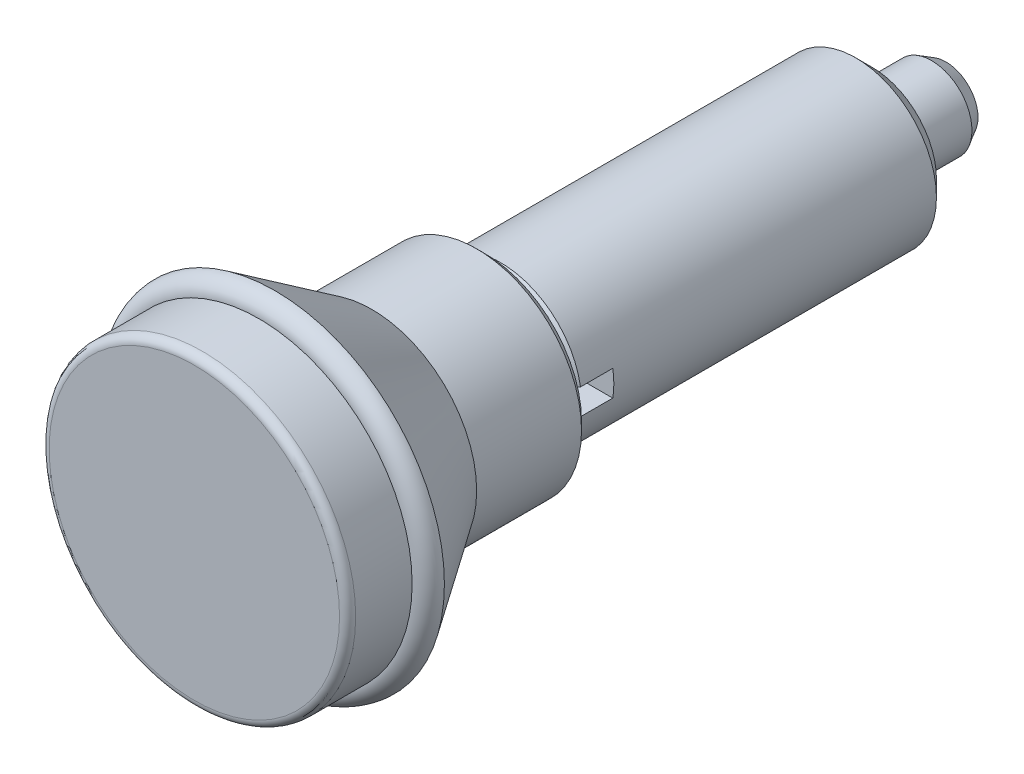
ISO-10303-21;
HEADER;
FILE_DESCRIPTION(('STEP AP214'),'2;1');
FILE_NAME('part.step','',(''),(''),'','','');
FILE_SCHEMA(('AUTOMOTIVE_DESIGN { 1 0 10303 214 1 1 1 1 }'));
ENDSEC;
DATA;
#1=APPLICATION_CONTEXT('core data for automotive mechanical design processes');
#2=APPLICATION_PROTOCOL_DEFINITION('international standard','automotive_design',2000,#1);
#3=PRODUCT_CONTEXT('',#1,'mechanical');
#4=PRODUCT('Part','Part','',(#3));
#5=PRODUCT_RELATED_PRODUCT_CATEGORY('part','',(#4));
#6=PRODUCT_DEFINITION_FORMATION('','',#4);
#7=PRODUCT_DEFINITION_CONTEXT('part definition',#1,'design');
#8=PRODUCT_DEFINITION('design','',#6,#7);
#9=PRODUCT_DEFINITION_SHAPE('','',#8);
#10=(LENGTH_UNIT() NAMED_UNIT(*) SI_UNIT(.MILLI.,.METRE.));
#11=(NAMED_UNIT(*) PLANE_ANGLE_UNIT() SI_UNIT($,.RADIAN.));
#12=(NAMED_UNIT(*) SI_UNIT($,.STERADIAN.) SOLID_ANGLE_UNIT());
#13=UNCERTAINTY_MEASURE_WITH_UNIT(LENGTH_MEASURE(1.E-05),#10,'distance_accuracy_value','');
#14=(GEOMETRIC_REPRESENTATION_CONTEXT(3) GLOBAL_UNCERTAINTY_ASSIGNED_CONTEXT((#13)) GLOBAL_UNIT_ASSIGNED_CONTEXT((#10,
#11,#12)) REPRESENTATION_CONTEXT('',''));
#15=CARTESIAN_POINT('',(0.,0.,0.));
#16=DIRECTION('',(0.,0.,1.));
#17=DIRECTION('',(1.,0.,0.));
#18=AXIS2_PLACEMENT_3D('',#15,#16,#17);
#19=CARTESIAN_POINT('',(0.,0.,42.));
#20=DIRECTION('',(0.,0.,1.));
#21=DIRECTION('',(1.,0.,0.));
#22=AXIS2_PLACEMENT_3D('',#19,#20,#21);
#23=CYLINDRICAL_SURFACE('',#22,5.0000000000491);
#24=CARTESIAN_POINT('',(0.,0.,0.999999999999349));
#25=DIRECTION('',(0.,0.,1.));
#26=DIRECTION('',(1.,0.,0.));
#27=AXIS2_PLACEMENT_3D('',#24,#25,#26);
#28=CIRCLE('',#27,5.0000000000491);
#29=CARTESIAN_POINT('',(5.0000000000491,0.,0.999999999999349));
#30=VERTEX_POINT('',#29);
#31=EDGE_CURVE('E219',#30,#30,#28,.T.);
#32=ORIENTED_EDGE('',*,*,#31,.T.);
#33=EDGE_LOOP('',(#32));
#34=FACE_BOUND('',#33,.T.);
#35=CARTESIAN_POINT('',(0.,0.,22.9999999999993));
#36=DIRECTION('',(0.,0.,1.));
#37=DIRECTION('',(1.,0.,0.));
#38=AXIS2_PLACEMENT_3D('',#35,#36,#37);
#39=CIRCLE('',#38,5.0000000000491);
#40=CARTESIAN_POINT('',(4.93558507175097,0.8,22.9999999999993));
#41=VERTEX_POINT('',#40);
#42=CARTESIAN_POINT('',(-4.93558507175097,0.8,22.9999999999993));
#43=VERTEX_POINT('',#42);
#44=EDGE_CURVE('E180',#41,#43,#39,.T.);
#45=ORIENTED_EDGE('',*,*,#44,.F.);
#46=DIRECTION('',(0.,0.,1.));
#47=VECTOR('',#46,1.);
#48=CARTESIAN_POINT('',(4.93558507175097,0.8,42.));
#49=LINE('',#48,#47);
#50=CARTESIAN_POINT('',(4.93558507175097,0.8,21.0000000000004));
#51=VERTEX_POINT('',#50);
#52=EDGE_CURVE('E152',#41,#51,#49,.F.);
#53=ORIENTED_EDGE('',*,*,#52,.T.);
#54=CARTESIAN_POINT('',(0.,0.,21.0000000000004));
#55=DIRECTION('',(0.,0.,-1.));
#56=DIRECTION('',(-1.,0.,0.));
#57=AXIS2_PLACEMENT_3D('',#54,#55,#56);
#58=CIRCLE('',#57,5.0000000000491);
#59=CARTESIAN_POINT('',(4.93558507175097,-0.8,21.0000000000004));
#60=VERTEX_POINT('',#59);
#61=EDGE_CURVE('E9',#60,#51,#58,.F.);
#62=ORIENTED_EDGE('',*,*,#61,.F.);
#63=DIRECTION('',(0.,0.,1.));
#64=VECTOR('',#63,1.);
#65=CARTESIAN_POINT('',(4.93558507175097,-0.8,42.));
#66=LINE('',#65,#64);
#67=CARTESIAN_POINT('',(4.93558507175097,-0.8,22.9999999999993));
#68=VERTEX_POINT('',#67);
#69=EDGE_CURVE('E127',#60,#68,#66,.T.);
#70=ORIENTED_EDGE('',*,*,#69,.T.);
#71=CARTESIAN_POINT('',(-4.93558507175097,-0.8,22.9999999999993));
#72=VERTEX_POINT('',#71);
#73=EDGE_CURVE('E181',#72,#68,#39,.T.);
#74=ORIENTED_EDGE('',*,*,#73,.F.);
#75=DIRECTION('',(0.,0.,1.));
#76=VECTOR('',#75,1.);
#77=CARTESIAN_POINT('',(-4.93558507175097,-0.8,42.));
#78=LINE('',#77,#76);
#79=CARTESIAN_POINT('',(-4.93558507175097,-0.8,21.0000000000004));
#80=VERTEX_POINT('',#79);
#81=EDGE_CURVE('E177',#72,#80,#78,.F.);
#82=ORIENTED_EDGE('',*,*,#81,.T.);
#83=CARTESIAN_POINT('',(0.,0.,21.0000000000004));
#84=DIRECTION('',(0.,0.,-1.));
#85=DIRECTION('',(-1.,0.,0.));
#86=AXIS2_PLACEMENT_3D('',#83,#84,#85);
#87=CIRCLE('',#86,5.0000000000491);
#88=CARTESIAN_POINT('',(-4.93558507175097,0.8,21.0000000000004));
#89=VERTEX_POINT('',#88);
#90=EDGE_CURVE('E21',#89,#80,#87,.F.);
#91=ORIENTED_EDGE('',*,*,#90,.F.);
#92=DIRECTION('',(0.,0.,1.));
#93=VECTOR('',#92,1.);
#94=CARTESIAN_POINT('',(-4.93558507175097,0.8,42.));
#95=LINE('',#94,#93);
#96=EDGE_CURVE('E174',#89,#43,#95,.T.);
#97=ORIENTED_EDGE('',*,*,#96,.T.);
#98=EDGE_LOOP('',(#45,#53,#62,#70,#74,#82,#91,#97));
#99=FACE_BOUND('',#98,.T.);
#100=ADVANCED_FACE('F14',(#34,#99),#23,.T.);
#101=CARTESIAN_POINT('',(0.,0.,24.0000000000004));
#102=DIRECTION('',(0.,0.,-1.));
#103=DIRECTION('',(-1.,0.,0.));
#104=AXIS2_PLACEMENT_3D('',#101,#102,#103);
#105=CONICAL_SURFACE('',#104,4.00000000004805,0.785398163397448);
#106=CARTESIAN_POINT('',(0.,0.,24.0000000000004));
#107=DIRECTION('',(0.,0.,1.));
#108=DIRECTION('',(1.,0.,0.));
#109=AXIS2_PLACEMENT_3D('',#106,#107,#108);
#110=CIRCLE('',#109,4.00000000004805);
#111=CARTESIAN_POINT('',(3.91918358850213,0.8,24.0000000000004));
#112=VERTEX_POINT('',#111);
#113=CARTESIAN_POINT('',(-3.91918358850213,0.8,24.0000000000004));
#114=VERTEX_POINT('',#113);
#115=EDGE_CURVE('E184',#112,#114,#110,.T.);
#116=ORIENTED_EDGE('',*,*,#115,.F.);
#117=CARTESIAN_POINT('',(1.51119310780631,0.8,26.2901156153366));
#118=CARTESIAN_POINT('',(1.57376665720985,0.8,26.2347897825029));
#119=CARTESIAN_POINT('',(1.6359889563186,0.8,26.1790705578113));
#120=CARTESIAN_POINT('',(1.75987195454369,0.8,26.0670153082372));
#121=CARTESIAN_POINT('',(1.82153267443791,0.8,26.0106793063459));
#122=CARTESIAN_POINT('',(1.94443244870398,0.8,25.8975614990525));
#123=CARTESIAN_POINT('',(2.00567154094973,0.8,25.8407797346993));
#124=CARTESIAN_POINT('',(2.12782290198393,0.8,25.7268646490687));
#125=CARTESIAN_POINT('',(2.18873516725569,0.8,25.6697313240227));
#126=CARTESIAN_POINT('',(2.37106944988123,0.8,25.497940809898));
#127=CARTESIAN_POINT('',(2.49210731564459,0.8,25.3828760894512));
#128=CARTESIAN_POINT('',(2.73351409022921,0.8,25.1520421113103));
#129=CARTESIAN_POINT('',(2.85388298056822,0.8,25.0362728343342));
#130=CARTESIAN_POINT('',(3.12012235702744,0.8,24.7791744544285));
#131=CARTESIAN_POINT('',(3.26588105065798,0.8,24.6377296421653));
#132=CARTESIAN_POINT('',(3.55693087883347,0.8,24.3543632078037));
#133=CARTESIAN_POINT('',(3.70222201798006,0.8,24.2124415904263));
#134=CARTESIAN_POINT('',(4.13763443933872,0.8,23.7861569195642));
#135=CARTESIAN_POINT('',(4.42727005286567,0.8,23.5012979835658));
#136=CARTESIAN_POINT('',(4.98009756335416,0.8,22.956242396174));
#137=CARTESIAN_POINT('',(5.2433494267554,0.8,22.6961064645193));
#138=CARTESIAN_POINT('',(5.76947260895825,0.799999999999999,22.1754502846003));
#139=CARTESIAN_POINT('',(6.03234392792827,0.799999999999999,21.9149300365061));
#140=CARTESIAN_POINT('',(6.55778567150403,0.799999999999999,21.3936806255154));
#141=CARTESIAN_POINT('',(6.82035614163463,0.799999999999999,21.1329515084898));
#142=CARTESIAN_POINT('',(7.34531202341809,0.799999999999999,20.6113073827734));
#143=CARTESIAN_POINT('',(7.60769743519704,0.799999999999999,20.3503923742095));
#144=CARTESIAN_POINT('',(7.87002479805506,0.8,20.0894190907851));
#145=B_SPLINE_CURVE_WITH_KNOTS('',3,(#117,#118,#119,#120,#121,#122,#123,#124,#125,#126,#127,
#128,#129,#130,#131,#132,#133,#134,#135,#136,#137,#138,#139,#140,#141,#142,#143,#144),
.UNSPECIFIED.,.F.,.F.,(4,2,2,2,2,2,2,2,2,2,2,2,2,4),(0.,0.250569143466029,0.501128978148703,
0.751666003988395,1.00220572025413,1.50321010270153,2.00422825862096,2.61354581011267,
3.222857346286,4.44158354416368,5.55187609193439,6.66216814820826,7.77226099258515,
8.88235307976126),.UNSPECIFIED.);
#146=EDGE_CURVE('E145',#112,#41,#145,.T.);
#147=ORIENTED_EDGE('',*,*,#146,.T.);
#148=ORIENTED_EDGE('',*,*,#44,.T.);
#149=CARTESIAN_POINT('',(-7.11531414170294,0.8,20.8398536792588));
#150=CARTESIAN_POINT('',(-6.85273529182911,0.8,21.1007727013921));
#151=CARTESIAN_POINT('',(-6.59008115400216,0.8,21.3616161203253));
#152=CARTESIAN_POINT('',(-6.06454923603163,0.8,21.883005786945));
#153=CARTESIAN_POINT('',(-5.80167149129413,0.8,22.1435520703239));
#154=CARTESIAN_POINT('',(-5.27565944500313,0.8,22.6641621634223));
#155=CARTESIAN_POINT('',(-5.01252529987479,0.8,22.9242261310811));
#156=CARTESIAN_POINT('',(-4.61736706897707,0.8,23.3138921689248));
#157=CARTESIAN_POINT('',(-4.48556309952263,0.8,23.4437174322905));
#158=CARTESIAN_POINT('',(-4.22176222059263,0.8,23.7031749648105));
#159=CARTESIAN_POINT('',(-4.08976530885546,0.8,23.8328072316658));
#160=CARTESIAN_POINT('',(-3.82540517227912,0.8,24.0919265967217));
#161=CARTESIAN_POINT('',(-3.6930417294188,0.8,24.2214134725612));
#162=CARTESIAN_POINT('',(-3.427977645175,0.8,24.4800307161));
#163=CARTESIAN_POINT('',(-3.2952770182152,0.8,24.6091610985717));
#164=CARTESIAN_POINT('',(-3.02944429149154,0.8,24.8668754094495));
#165=CARTESIAN_POINT('',(-2.89631237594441,0.8,24.9954595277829));
#166=CARTESIAN_POINT('',(-2.6293255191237,0.8,25.2519172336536));
#167=CARTESIAN_POINT('',(-2.49547047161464,0.8,25.3797907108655));
#168=CARTESIAN_POINT('',(-2.29377475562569,0.8,25.5708141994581));
#169=CARTESIAN_POINT('',(-2.22634609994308,0.8,25.6343990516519));
#170=CARTESIAN_POINT('',(-2.0911338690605,0.8,25.7611864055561));
#171=CARTESIAN_POINT('',(-2.02335030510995,0.8,25.8243889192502));
#172=CARTESIAN_POINT('',(-1.88734942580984,0.8,25.950262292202));
#173=CARTESIAN_POINT('',(-1.8191323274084,0.8,26.0129333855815));
#174=CARTESIAN_POINT('',(-1.68206697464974,0.8,26.1375995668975));
#175=CARTESIAN_POINT('',(-1.61321864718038,0.8,26.1995945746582));
#176=CARTESIAN_POINT('',(-1.47453924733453,0.8,26.3227267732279));
#177=CARTESIAN_POINT('',(-1.40470665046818,0.8,26.3838622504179));
#178=CARTESIAN_POINT('',(-1.26383305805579,0.8,26.5046904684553));
#179=CARTESIAN_POINT('',(-1.1927924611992,0.8,26.5643836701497));
#180=CARTESIAN_POINT('',(-1.08478944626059,0.8,26.6522851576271));
#181=CARTESIAN_POINT('',(-1.04851531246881,0.8,26.6813376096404));
#182=CARTESIAN_POINT('',(-0.975391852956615,0.8,26.7387011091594));
#183=CARTESIAN_POINT('',(-0.938542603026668,0.8,26.7670122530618));
#184=CARTESIAN_POINT('',(-0.864080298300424,0.8,26.822707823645));
#185=CARTESIAN_POINT('',(-0.826466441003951,0.8,26.8500911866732));
#186=CARTESIAN_POINT('',(-0.750292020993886,0.8,26.9035412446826));
#187=CARTESIAN_POINT('',(-0.711731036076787,0.8,26.9296073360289));
#188=CARTESIAN_POINT('',(-0.672602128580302,0.8,26.9548236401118));
#189=B_SPLINE_CURVE_WITH_KNOTS('',3,(#149,#150,#151,#152,#153,#154,#155,#156,#157,#158,#159,
#160,#161,#162,#163,#164,#165,#166,#167,#168,#169,#170,#171,#172,#173,#174,#175,#176,#177,#178,
#179,#180,#181,#182,#183,#184,#185,#186,#187,#188),.UNSPECIFIED.,.F.,.F.,(4,2,2,2,2,2,2,2,2,2,2,
2,2,2,2,2,2,2,2,4),(0.,1.11051241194,2.22087329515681,3.33076249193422,3.88577763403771,
4.440799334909,4.9963008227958,5.55177893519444,6.10704482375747,6.66239463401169,
6.94043478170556,7.21846616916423,7.49636793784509,7.77430231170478,8.05272890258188,
8.33106531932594,8.47048075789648,8.60987797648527,8.74942994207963,8.88904528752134),.UNSPECIFIED.);
#190=EDGE_CURVE('E222',#43,#114,#189,.T.);
#191=ORIENTED_EDGE('',*,*,#190,.T.);
#192=EDGE_LOOP('',(#116,#147,#148,#191));
#193=FACE_BOUND('',#192,.T.);
#194=ADVANCED_FACE('F129',(#193),#105,.T.);
#195=ORIENTED_EDGE('',*,*,#73,.T.);
#196=CARTESIAN_POINT('',(7.87002479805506,-0.8,20.0894190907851));
#197=CARTESIAN_POINT('',(7.6076623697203,-0.800000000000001,20.3504270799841));
#198=CARTESIAN_POINT('',(7.34524200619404,-0.800000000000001,20.6113769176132));
#199=CARTESIAN_POINT('',(6.82022035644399,-0.800000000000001,21.1330864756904));
#200=CARTESIAN_POINT('',(6.55761907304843,-0.800000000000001,21.3938461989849));
#201=CARTESIAN_POINT('',(6.03218109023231,-0.800000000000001,21.9150912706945));
#202=CARTESIAN_POINT('',(5.76934440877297,-0.800000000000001,22.1755766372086));
#203=CARTESIAN_POINT('',(5.24328766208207,-0.8,22.6961681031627));
#204=CARTESIAN_POINT('',(4.98006759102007,-0.8,22.9562741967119));
#205=CARTESIAN_POINT('',(4.45300501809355,-0.8,23.4759225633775));
#206=CARTESIAN_POINT('',(4.18916244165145,-0.8,23.7354647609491));
#207=CARTESIAN_POINT('',(3.79263938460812,-0.8,24.1239927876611));
#208=CARTESIAN_POINT('',(3.66034118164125,-0.8,24.2533686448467));
#209=CARTESIAN_POINT('',(3.39539092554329,-0.8,24.5117605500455));
#210=CARTESIAN_POINT('',(3.26273886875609,-0.8,24.6407765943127));
#211=CARTESIAN_POINT('',(2.99692077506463,-0.8,24.8983148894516));
#212=CARTESIAN_POINT('',(2.86375467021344,-0.8,25.0268370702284));
#213=CARTESIAN_POINT('',(2.59669959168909,-0.8,25.2831224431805));
#214=CARTESIAN_POINT('',(2.46281063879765,-0.8,25.4108856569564));
#215=CARTESIAN_POINT('',(2.26111109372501,-0.8,25.601635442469));
#216=CARTESIAN_POINT('',(2.19372846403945,-0.8,25.6650742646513));
#217=CARTESIAN_POINT('',(2.05859195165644,-0.8,25.7915537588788));
#218=CARTESIAN_POINT('',(1.99083807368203,-0.8,25.8545944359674));
#219=CARTESIAN_POINT('',(1.85484198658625,-0.8,25.9801618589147));
#220=CARTESIAN_POINT('',(1.78659972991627,-0.8,26.0426885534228));
#221=CARTESIAN_POINT('',(1.64944487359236,-0.8,26.1670076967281));
#222=CARTESIAN_POINT('',(1.5805322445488,-0.8,26.2288001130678));
#223=CARTESIAN_POINT('',(1.51119310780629,-0.8,26.2901156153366));
#224=B_SPLINE_CURVE_WITH_KNOTS('',3,(#196,#197,#198,#199,#200,#201,#202,#203,#204,#205,#206,
#207,#208,#209,#210,#211,#212,#213,#214,#215,#216,#217,#218,#219,#220,#221,#222,#223),
.UNSPECIFIED.,.F.,.F.,(4,2,2,2,2,2,2,2,2,2,2,2,2,4),(0.,1.11024010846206,2.22046323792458,
3.33060785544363,4.44076953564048,5.5510717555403,6.10620042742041,6.66133485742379,
7.21654536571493,7.77173999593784,8.04937903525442,8.32701455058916,8.60467747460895,
8.882352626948),.UNSPECIFIED.);
#225=CARTESIAN_POINT('',(3.91918358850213,-0.8,24.0000000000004));
#226=VERTEX_POINT('',#225);
#227=EDGE_CURVE('E105',#68,#226,#224,.T.);
#228=ORIENTED_EDGE('',*,*,#227,.T.);
#229=CARTESIAN_POINT('',(-3.91918358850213,-0.8,24.0000000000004));
#230=VERTEX_POINT('',#229);
#231=EDGE_CURVE('E94',#230,#226,#110,.T.);
#232=ORIENTED_EDGE('',*,*,#231,.F.);
#233=CARTESIAN_POINT('',(-0.672602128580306,-0.8,26.9548236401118));
#234=CARTESIAN_POINT('',(-0.715869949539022,-0.8,26.9269281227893));
#235=CARTESIAN_POINT('',(-0.758447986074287,-0.8,26.8980065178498));
#236=CARTESIAN_POINT('',(-0.842470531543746,-0.8,26.8386021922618));
#237=CARTESIAN_POINT('',(-0.883915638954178,-0.8,26.8081203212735));
#238=CARTESIAN_POINT('',(-0.965911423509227,-0.8,26.7460955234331));
#239=CARTESIAN_POINT('',(-1.00646318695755,-0.8,26.7145540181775));
#240=CARTESIAN_POINT('',(-1.08691237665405,-0.8,26.650636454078));
#241=CARTESIAN_POINT('',(-1.12680970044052,-0.8,26.6182602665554));
#242=CARTESIAN_POINT('',(-1.24559261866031,-0.8,26.5203102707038));
#243=CARTESIAN_POINT('',(-1.32370960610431,-0.8,26.453806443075));
#244=CARTESIAN_POINT('',(-1.47864191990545,-0.8,26.3192485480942));
#245=CARTESIAN_POINT('',(-1.55545668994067,-0.8,26.2511938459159));
#246=CARTESIAN_POINT('',(-1.73142842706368,-0.8,26.0931934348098));
#247=CARTESIAN_POINT('',(-1.83026578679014,-0.8,26.0028923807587));
#248=CARTESIAN_POINT('',(-2.02694647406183,-0.8,25.8212141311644));
#249=CARTESIAN_POINT('',(-2.12478977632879,-0.8,25.7298369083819));
#250=CARTESIAN_POINT('',(-2.31978288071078,-0.8,25.5463694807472));
#251=CARTESIAN_POINT('',(-2.41693276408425,-0.8,25.4542793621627));
#252=CARTESIAN_POINT('',(-2.61074692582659,-0.8,25.2695891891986));
#253=CARTESIAN_POINT('',(-2.70741120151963,-0.8,25.1769891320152));
#254=CARTESIAN_POINT('',(-2.99723078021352,-0.8,24.8982998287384));
#255=CARTESIAN_POINT('',(-3.18985587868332,-0.8,24.7116595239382));
#256=CARTESIAN_POINT('',(-3.57428841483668,-0.8,24.3375385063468));
#257=CARTESIAN_POINT('',(-3.76609584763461,-0.8,24.1500577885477));
#258=CARTESIAN_POINT('',(-4.22231719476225,-0.8,23.7028863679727));
#259=CARTESIAN_POINT('',(-4.48649383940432,-0.8,23.4429536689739));
#260=CARTESIAN_POINT('',(-5.01426697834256,-0.8,22.9225013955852));
#261=CARTESIAN_POINT('',(-5.27786347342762,-0.8,22.6619818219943));
#262=CARTESIAN_POINT('',(-5.80390987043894,-0.8,22.1413356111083));
#263=CARTESIAN_POINT('',(-6.06636086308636,-0.8,21.8812100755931));
#264=CARTESIAN_POINT('',(-6.59100395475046,-0.8,21.3606989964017));
#265=CARTESIAN_POINT('',(-6.85319605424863,-0.8,21.1003134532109));
#266=CARTESIAN_POINT('',(-7.11531414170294,-0.8,20.8398536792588));
#267=B_SPLINE_CURVE_WITH_KNOTS('',3,(#233,#234,#235,#236,#237,#238,#239,#240,#241,#242,#243,
#244,#245,#246,#247,#248,#249,#250,#251,#252,#253,#254,#255,#256,#257,#258,#259,#260,#261,#262,
#263,#264,#265,#266),.UNSPECIFIED.,.F.,.F.,(4,2,2,2,2,2,2,2,2,2,2,2,2,2,2,2,4),(0.,
0.154393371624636,0.30870354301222,0.462814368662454,0.616949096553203,0.924686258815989,
1.23255173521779,1.63416882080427,2.03579609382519,2.43737550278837,2.8389571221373,
3.6435952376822,4.44823815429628,5.56007648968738,6.67191331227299,7.78047627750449,
8.88903717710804),.UNSPECIFIED.);
#268=EDGE_CURVE('E229',#230,#72,#267,.T.);
#269=ORIENTED_EDGE('',*,*,#268,.T.);
#270=EDGE_LOOP('',(#195,#228,#232,#269));
#271=FACE_BOUND('',#270,.T.);
#272=ADVANCED_FACE('F259',(#271),#105,.T.);
#273=CARTESIAN_POINT('',(0.,0.,0.999999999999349));
#274=DIRECTION('',(0.,0.,1.));
#275=DIRECTION('',(1.,0.,0.));
#276=AXIS2_PLACEMENT_3D('',#273,#274,#275);
#277=CONICAL_SURFACE('',#276,5.0000000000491,0.785398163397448);
#278=CARTESIAN_POINT('',(0.,0.,0.));
#279=DIRECTION('',(0.,0.,1.));
#280=DIRECTION('',(1.,0.,0.));
#281=AXIS2_PLACEMENT_3D('',#278,#279,#280);
#282=CIRCLE('',#281,4.00000000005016);
#283=CARTESIAN_POINT('',(4.00000000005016,0.,0.));
#284=VERTEX_POINT('',#283);
#285=EDGE_CURVE('E216',#284,#284,#282,.T.);
#286=ORIENTED_EDGE('',*,*,#285,.T.);
#287=EDGE_LOOP('',(#286));
#288=FACE_BOUND('',#287,.T.);
#289=ORIENTED_EDGE('',*,*,#31,.F.);
#290=EDGE_LOOP('',(#289));
#291=FACE_BOUND('',#290,.T.);
#292=ADVANCED_FACE('F360',(#288,#291),#277,.T.);
#293=CARTESIAN_POINT('',(0.,4.00000000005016,0.));
#294=DIRECTION('',(0.,0.,-1.));
#295=DIRECTION('',(-1.,0.,0.));
#296=AXIS2_PLACEMENT_3D('',#293,#294,#295);
#297=PLANE('',#296);
#298=CARTESIAN_POINT('',(0.,0.,0.));
#299=DIRECTION('',(0.,0.,1.));
#300=DIRECTION('',(1.,0.,0.));
#301=AXIS2_PLACEMENT_3D('',#298,#299,#300);
#302=CIRCLE('',#301,2.5);
#303=CARTESIAN_POINT('',(2.5,0.,0.));
#304=VERTEX_POINT('',#303);
#305=EDGE_CURVE('E213',#304,#304,#302,.T.);
#306=ORIENTED_EDGE('',*,*,#305,.T.);
#307=EDGE_LOOP('',(#306));
#308=FACE_BOUND('',#307,.T.);
#309=ORIENTED_EDGE('',*,*,#285,.F.);
#310=EDGE_LOOP('',(#309));
#311=FACE_BOUND('',#310,.T.);
#312=ADVANCED_FACE('F366',(#308,#311),#297,.T.);
#313=CARTESIAN_POINT('',(0.,0.,42.));
#314=DIRECTION('',(0.,0.,1.));
#315=DIRECTION('',(1.,0.,0.));
#316=AXIS2_PLACEMENT_3D('',#313,#314,#315);
#317=CYLINDRICAL_SURFACE('',#316,2.5);
#318=CARTESIAN_POINT('',(0.,0.,-3.7));
#319=DIRECTION('',(0.,0.,1.));
#320=DIRECTION('',(1.,0.,0.));
#321=AXIS2_PLACEMENT_3D('',#318,#319,#320);
#322=CIRCLE('',#321,2.5);
#323=CARTESIAN_POINT('',(2.5,0.,-3.7));
#324=VERTEX_POINT('',#323);
#325=EDGE_CURVE('E210',#324,#324,#322,.T.);
#326=ORIENTED_EDGE('',*,*,#325,.T.);
#327=EDGE_LOOP('',(#326));
#328=FACE_BOUND('',#327,.T.);
#329=ORIENTED_EDGE('',*,*,#305,.F.);
#330=EDGE_LOOP('',(#329));
#331=FACE_BOUND('',#330,.T.);
#332=ADVANCED_FACE('F374',(#328,#331),#317,.T.);
#333=CARTESIAN_POINT('',(0.,0.,-3.7));
#334=DIRECTION('',(0.,0.,1.));
#335=DIRECTION('',(1.,0.,0.));
#336=AXIS2_PLACEMENT_3D('',#333,#334,#335);
#337=CONICAL_SURFACE('',#336,2.5,0.523598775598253);
#338=CARTESIAN_POINT('',(0.,0.,-4.588122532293));
#339=DIRECTION('',(0.,0.,1.));
#340=DIRECTION('',(1.,0.,0.));
#341=AXIS2_PLACEMENT_3D('',#338,#339,#340);
#342=CIRCLE('',#341,1.98724221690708);
#343=CARTESIAN_POINT('',(1.98724221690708,0.,-4.588122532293));
#344=VERTEX_POINT('',#343);
#345=EDGE_CURVE('E207',#344,#344,#342,.T.);
#346=ORIENTED_EDGE('',*,*,#345,.T.);
#347=EDGE_LOOP('',(#346));
#348=FACE_BOUND('',#347,.T.);
#349=ORIENTED_EDGE('',*,*,#325,.F.);
#350=EDGE_LOOP('',(#349));
#351=FACE_BOUND('',#350,.T.);
#352=ADVANCED_FACE('F383',(#348,#351),#337,.T.);
#353=CARTESIAN_POINT('',(0.,0.,0.));
#354=DIRECTION('',(0.,0.,1.));
#355=DIRECTION('',(0.,1.,0.));
#356=AXIS2_PLACEMENT_3D('',#353,#354,#355);
#357=SPHERICAL_SURFACE('',#356,4.99999999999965);
#358=ORIENTED_EDGE('',*,*,#345,.F.);
#359=EDGE_LOOP('',(#358));
#360=FACE_BOUND('',#359,.T.);
#361=ADVANCED_FACE('F392',(#360),#357,.T.);
#362=CARTESIAN_POINT('',(0.,9.,42.));
#363=DIRECTION('',(0.,0.,1.));
#364=DIRECTION('',(1.,0.,0.));
#365=AXIS2_PLACEMENT_3D('',#362,#363,#364);
#366=PLANE('',#365);
#367=CARTESIAN_POINT('',(0.,0.,42.));
#368=DIRECTION('',(0.,0.,1.));
#369=DIRECTION('',(1.,0.,0.));
#370=AXIS2_PLACEMENT_3D('',#367,#368,#369);
#371=CIRCLE('',#370,9.);
#372=CARTESIAN_POINT('',(9.,0.,42.));
#373=VERTEX_POINT('',#372);
#374=EDGE_CURVE('E204',#373,#373,#371,.T.);
#375=ORIENTED_EDGE('',*,*,#374,.T.);
#376=EDGE_LOOP('',(#375));
#377=FACE_BOUND('',#376,.T.);
#378=ADVANCED_FACE('F401',(#377),#366,.T.);
#379=CARTESIAN_POINT('',(0.,0.,41.5));
#380=DIRECTION('',(0.,0.,1.));
#381=DIRECTION('',(1.,0.,0.));
#382=AXIS2_PLACEMENT_3D('',#379,#380,#381);
#383=TOROIDAL_SURFACE('',#382,9.,0.5);
#384=CARTESIAN_POINT('',(0.,0.,41.5));
#385=DIRECTION('',(0.,0.,1.));
#386=DIRECTION('',(1.,0.,0.));
#387=AXIS2_PLACEMENT_3D('',#384,#385,#386);
#388=CIRCLE('',#387,9.5);
#389=CARTESIAN_POINT('',(9.5,0.,41.5));
#390=VERTEX_POINT('',#389);
#391=EDGE_CURVE('E201',#390,#390,#388,.T.);
#392=ORIENTED_EDGE('',*,*,#391,.T.);
#393=EDGE_LOOP('',(#392));
#394=FACE_BOUND('',#393,.T.);
#395=ORIENTED_EDGE('',*,*,#374,.F.);
#396=EDGE_LOOP('',(#395));
#397=FACE_BOUND('',#396,.T.);
#398=ADVANCED_FACE('F410',(#394,#397),#383,.T.);
#399=CARTESIAN_POINT('',(0.,0.,42.));
#400=DIRECTION('',(0.,0.,1.));
#401=DIRECTION('',(1.,0.,0.));
#402=AXIS2_PLACEMENT_3D('',#399,#400,#401);
#403=CYLINDRICAL_SURFACE('',#402,9.5);
#404=CARTESIAN_POINT('',(0.,0.,38.));
#405=DIRECTION('',(0.,0.,1.));
#406=DIRECTION('',(1.,0.,0.));
#407=AXIS2_PLACEMENT_3D('',#404,#405,#406);
#408=CIRCLE('',#407,9.5);
#409=CARTESIAN_POINT('',(9.5,0.,38.));
#410=VERTEX_POINT('',#409);
#411=EDGE_CURVE('E198',#410,#410,#408,.T.);
#412=ORIENTED_EDGE('',*,*,#411,.T.);
#413=EDGE_LOOP('',(#412));
#414=FACE_BOUND('',#413,.T.);
#415=ORIENTED_EDGE('',*,*,#391,.F.);
#416=EDGE_LOOP('',(#415));
#417=FACE_BOUND('',#416,.T.);
#418=ADVANCED_FACE('F419',(#414,#417),#403,.T.);
#419=CARTESIAN_POINT('',(0.,0.,37.));
#420=DIRECTION('',(0.,0.,1.));
#421=DIRECTION('',(1.,0.,0.));
#422=AXIS2_PLACEMENT_3D('',#419,#420,#421);
#423=TOROIDAL_SURFACE('',#422,9.5,0.999999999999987);
#424=CARTESIAN_POINT('',(0.,0.,37.));
#425=DIRECTION('',(0.,0.,1.));
#426=DIRECTION('',(1.,0.,0.));
#427=AXIS2_PLACEMENT_3D('',#424,#425,#426);
#428=CIRCLE('',#427,10.5);
#429=CARTESIAN_POINT('',(10.5,0.,37.));
#430=VERTEX_POINT('',#429);
#431=EDGE_CURVE('E195',#430,#430,#428,.T.);
#432=ORIENTED_EDGE('',*,*,#431,.T.);
#433=EDGE_LOOP('',(#432));
#434=FACE_BOUND('',#433,.T.);
#435=ORIENTED_EDGE('',*,*,#411,.F.);
#436=EDGE_LOOP('',(#435));
#437=FACE_BOUND('',#436,.T.);
#438=ADVANCED_FACE('F428',(#434,#437),#423,.T.);
#439=CARTESIAN_POINT('',(0.,0.,37.));
#440=DIRECTION('',(0.,0.,1.));
#441=DIRECTION('',(1.,0.,0.));
#442=AXIS2_PLACEMENT_3D('',#439,#440,#441);
#443=CONICAL_SURFACE('',#442,10.5,0.588002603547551);
#444=CARTESIAN_POINT('',(0.,0.,31.0000000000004));
#445=DIRECTION('',(0.,0.,1.));
#446=DIRECTION('',(1.,0.,0.));
#447=AXIS2_PLACEMENT_3D('',#444,#445,#446);
#448=CIRCLE('',#447,6.5);
#449=CARTESIAN_POINT('',(6.5,0.,31.0000000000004));
#450=VERTEX_POINT('',#449);
#451=EDGE_CURVE('E192',#450,#450,#448,.T.);
#452=ORIENTED_EDGE('',*,*,#451,.T.);
#453=EDGE_LOOP('',(#452));
#454=FACE_BOUND('',#453,.T.);
#455=ORIENTED_EDGE('',*,*,#431,.F.);
#456=EDGE_LOOP('',(#455));
#457=FACE_BOUND('',#456,.T.);
#458=ADVANCED_FACE('F437',(#454,#457),#443,.T.);
#459=CARTESIAN_POINT('',(0.,0.,42.));
#460=DIRECTION('',(0.,0.,1.));
#461=DIRECTION('',(1.,0.,0.));
#462=AXIS2_PLACEMENT_3D('',#459,#460,#461);
#463=CYLINDRICAL_SURFACE('',#462,6.50000000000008);
#464=CARTESIAN_POINT('',(0.,0.,24.5000000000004));
#465=DIRECTION('',(0.,0.,1.));
#466=DIRECTION('',(1.,0.,0.));
#467=AXIS2_PLACEMENT_3D('',#464,#465,#466);
#468=CIRCLE('',#467,6.50000000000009);
#469=CARTESIAN_POINT('',(6.50000000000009,0.,24.5000000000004));
#470=VERTEX_POINT('',#469);
#471=EDGE_CURVE('E189',#470,#470,#468,.T.);
#472=ORIENTED_EDGE('',*,*,#471,.T.);
#473=EDGE_LOOP('',(#472));
#474=FACE_BOUND('',#473,.T.);
#475=ORIENTED_EDGE('',*,*,#451,.F.);
#476=EDGE_LOOP('',(#475));
#477=FACE_BOUND('',#476,.T.);
#478=ADVANCED_FACE('F446',(#474,#477),#463,.T.);
#479=CARTESIAN_POINT('',(0.,0.,24.5000000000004));
#480=DIRECTION('',(0.,0.,1.));
#481=DIRECTION('',(1.,0.,0.));
#482=AXIS2_PLACEMENT_3D('',#479,#480,#481);
#483=CONICAL_SURFACE('',#482,6.50000000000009,0.785398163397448);
#484=CARTESIAN_POINT('',(0.,0.,24.0000000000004));
#485=DIRECTION('',(0.,0.,1.));
#486=DIRECTION('',(1.,0.,0.));
#487=AXIS2_PLACEMENT_3D('',#484,#485,#486);
#488=CIRCLE('',#487,6.00000000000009);
#489=CARTESIAN_POINT('',(6.00000000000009,0.,24.0000000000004));
#490=VERTEX_POINT('',#489);
#491=EDGE_CURVE('E186',#490,#490,#488,.T.);
#492=ORIENTED_EDGE('',*,*,#491,.T.);
#493=EDGE_LOOP('',(#492));
#494=FACE_BOUND('',#493,.T.);
#495=ORIENTED_EDGE('',*,*,#471,.F.);
#496=EDGE_LOOP('',(#495));
#497=FACE_BOUND('',#496,.T.);
#498=ADVANCED_FACE('F251',(#494,#497),#483,.T.);
#499=CARTESIAN_POINT('',(0.,6.00000000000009,24.0000000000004));
#500=DIRECTION('',(0.,0.,-1.));
#501=DIRECTION('',(-1.,0.,0.));
#502=AXIS2_PLACEMENT_3D('',#499,#500,#501);
#503=PLANE('',#502);
#504=ORIENTED_EDGE('',*,*,#231,.T.);
#505=DIRECTION('',(-1.,0.,0.));
#506=VECTOR('',#505,1.);
#507=CARTESIAN_POINT('',(3.,-0.8,24.0000000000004));
#508=LINE('',#507,#506);
#509=CARTESIAN_POINT('',(3.,-0.8,24.0000000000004));
#510=VERTEX_POINT('',#509);
#511=EDGE_CURVE('E86',#226,#510,#508,.T.);
#512=ORIENTED_EDGE('',*,*,#511,.T.);
#513=DIRECTION('',(0.,1.,0.));
#514=VECTOR('',#513,1.);
#515=CARTESIAN_POINT('',(3.,0.8,24.0000000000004));
#516=LINE('',#515,#514);
#517=CARTESIAN_POINT('',(3.,0.8,24.0000000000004));
#518=VERTEX_POINT('',#517);
#519=EDGE_CURVE('E91',#510,#518,#516,.T.);
#520=ORIENTED_EDGE('',*,*,#519,.T.);
#521=DIRECTION('',(1.,0.,0.));
#522=VECTOR('',#521,1.);
#523=CARTESIAN_POINT('',(3.,0.8,24.0000000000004));
#524=LINE('',#523,#522);
#525=EDGE_CURVE('E28',#518,#112,#524,.T.);
#526=ORIENTED_EDGE('',*,*,#525,.T.);
#527=ORIENTED_EDGE('',*,*,#115,.T.);
#528=DIRECTION('',(1.,0.,0.));
#529=VECTOR('',#528,1.);
#530=CARTESIAN_POINT('',(-3.,0.8,24.0000000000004));
#531=LINE('',#530,#529);
#532=CARTESIAN_POINT('',(-3.,0.8,24.0000000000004));
#533=VERTEX_POINT('',#532);
#534=EDGE_CURVE('E158',#114,#533,#531,.T.);
#535=ORIENTED_EDGE('',*,*,#534,.T.);
#536=DIRECTION('',(0.,-1.,0.));
#537=VECTOR('',#536,1.);
#538=CARTESIAN_POINT('',(-3.,0.8,24.0000000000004));
#539=LINE('',#538,#537);
#540=CARTESIAN_POINT('',(-3.,-0.8,24.0000000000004));
#541=VERTEX_POINT('',#540);
#542=EDGE_CURVE('E155',#533,#541,#539,.T.);
#543=ORIENTED_EDGE('',*,*,#542,.T.);
#544=DIRECTION('',(-1.,0.,0.));
#545=VECTOR('',#544,1.);
#546=CARTESIAN_POINT('',(-3.,-0.8,24.0000000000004));
#547=LINE('',#546,#545);
#548=EDGE_CURVE('E35',#541,#230,#547,.T.);
#549=ORIENTED_EDGE('',*,*,#548,.T.);
#550=EDGE_LOOP('',(#504,#512,#520,#526,#527,#535,#543,#549));
#551=FACE_BOUND('',#550,.T.);
#552=ORIENTED_EDGE('',*,*,#491,.F.);
#553=EDGE_LOOP('',(#552));
#554=FACE_BOUND('',#553,.T.);
#555=ADVANCED_FACE('F88',(#551,#554),#503,.T.);
#556=CARTESIAN_POINT('',(-3.,0.8,21.0000000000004));
#557=DIRECTION('',(-1.,0.,0.));
#558=DIRECTION('',(0.,-1.,0.));
#559=AXIS2_PLACEMENT_3D('',#556,#557,#558);
#560=PLANE('',#559);
#561=ORIENTED_EDGE('',*,*,#542,.F.);
#562=DIRECTION('',(0.,0.,1.));
#563=VECTOR('',#562,1.);
#564=CARTESIAN_POINT('',(-3.,0.8,21.0000000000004));
#565=LINE('',#564,#563);
#566=CARTESIAN_POINT('',(-3.,0.8,21.0000000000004));
#567=VERTEX_POINT('',#566);
#568=EDGE_CURVE('E168',#567,#533,#565,.T.);
#569=ORIENTED_EDGE('',*,*,#568,.F.);
#570=DIRECTION('',(0.,-1.,0.));
#571=VECTOR('',#570,1.);
#572=CARTESIAN_POINT('',(-3.,0.8,21.0000000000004));
#573=LINE('',#572,#571);
#574=CARTESIAN_POINT('',(-3.,-0.8,21.0000000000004));
#575=VERTEX_POINT('',#574);
#576=EDGE_CURVE('E160',#567,#575,#573,.T.);
#577=ORIENTED_EDGE('',*,*,#576,.T.);
#578=DIRECTION('',(0.,0.,1.));
#579=VECTOR('',#578,1.);
#580=CARTESIAN_POINT('',(-3.,-0.8,21.0000000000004));
#581=LINE('',#580,#579);
#582=EDGE_CURVE('E171',#575,#541,#581,.T.);
#583=ORIENTED_EDGE('',*,*,#582,.T.);
#584=EDGE_LOOP('',(#561,#569,#577,#583));
#585=FACE_BOUND('',#584,.T.);
#586=ADVANCED_FACE('F242',(#585),#560,.T.);
#587=CARTESIAN_POINT('',(-3.,-0.8,21.0000000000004));
#588=DIRECTION('',(0.,1.,0.));
#589=DIRECTION('',(-1.,0.,0.));
#590=AXIS2_PLACEMENT_3D('',#587,#588,#589);
#591=PLANE('',#590);
#592=ORIENTED_EDGE('',*,*,#268,.F.);
#593=ORIENTED_EDGE('',*,*,#548,.F.);
#594=ORIENTED_EDGE('',*,*,#582,.F.);
#595=DIRECTION('',(-1.,0.,0.));
#596=VECTOR('',#595,1.);
#597=CARTESIAN_POINT('',(-3.,-0.8,21.0000000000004));
#598=LINE('',#597,#596);
#599=EDGE_CURVE('E163',#575,#80,#598,.T.);
#600=ORIENTED_EDGE('',*,*,#599,.T.);
#601=ORIENTED_EDGE('',*,*,#81,.F.);
#602=EDGE_LOOP('',(#592,#593,#594,#600,#601));
#603=FACE_BOUND('',#602,.T.);
#604=ADVANCED_FACE('F238',(#603),#591,.T.);
#605=CARTESIAN_POINT('',(-3.,0.8,21.0000000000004));
#606=DIRECTION('',(0.,-1.,0.));
#607=DIRECTION('',(1.,0.,0.));
#608=AXIS2_PLACEMENT_3D('',#605,#606,#607);
#609=PLANE('',#608);
#610=DIRECTION('',(1.,0.,0.));
#611=VECTOR('',#610,1.);
#612=CARTESIAN_POINT('',(-3.,0.8,21.0000000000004));
#613=LINE('',#612,#611);
#614=EDGE_CURVE('E166',#89,#567,#613,.T.);
#615=ORIENTED_EDGE('',*,*,#614,.T.);
#616=ORIENTED_EDGE('',*,*,#568,.T.);
#617=ORIENTED_EDGE('',*,*,#534,.F.);
#618=ORIENTED_EDGE('',*,*,#190,.F.);
#619=ORIENTED_EDGE('',*,*,#96,.F.);
#620=EDGE_LOOP('',(#615,#616,#617,#618,#619));
#621=FACE_BOUND('',#620,.T.);
#622=ADVANCED_FACE('F235',(#621),#609,.T.);
#623=CARTESIAN_POINT('',(-3.,-0.8,21.0000000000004));
#624=DIRECTION('',(0.,0.,-1.));
#625=DIRECTION('',(-1.,0.,0.));
#626=AXIS2_PLACEMENT_3D('',#623,#624,#625);
#627=PLANE('',#626);
#628=ORIENTED_EDGE('',*,*,#90,.T.);
#629=ORIENTED_EDGE('',*,*,#599,.F.);
#630=ORIENTED_EDGE('',*,*,#576,.F.);
#631=ORIENTED_EDGE('',*,*,#614,.F.);
#632=EDGE_LOOP('',(#628,#629,#630,#631));
#633=FACE_BOUND('',#632,.T.);
#634=ADVANCED_FACE('F142',(#633),#627,.F.);
#635=CARTESIAN_POINT('',(3.,0.8,21.0000000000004));
#636=DIRECTION('',(0.,-1.,0.));
#637=DIRECTION('',(1.,0.,0.));
#638=AXIS2_PLACEMENT_3D('',#635,#636,#637);
#639=PLANE('',#638);
#640=ORIENTED_EDGE('',*,*,#146,.F.);
#641=ORIENTED_EDGE('',*,*,#525,.F.);
#642=DIRECTION('',(0.,0.,1.));
#643=VECTOR('',#642,1.);
#644=CARTESIAN_POINT('',(3.,0.8,21.0000000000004));
#645=LINE('',#644,#643);
#646=CARTESIAN_POINT('',(3.,0.8,21.0000000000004));
#647=VERTEX_POINT('',#646);
#648=EDGE_CURVE('E106',#647,#518,#645,.T.);
#649=ORIENTED_EDGE('',*,*,#648,.F.);
#650=DIRECTION('',(1.,0.,0.));
#651=VECTOR('',#650,1.);
#652=CARTESIAN_POINT('',(3.,0.8,21.0000000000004));
#653=LINE('',#652,#651);
#654=EDGE_CURVE('E110',#647,#51,#653,.T.);
#655=ORIENTED_EDGE('',*,*,#654,.T.);
#656=ORIENTED_EDGE('',*,*,#52,.F.);
#657=EDGE_LOOP('',(#640,#641,#649,#655,#656));
#658=FACE_BOUND('',#657,.T.);
#659=ADVANCED_FACE('F137',(#658),#639,.T.);
#660=CARTESIAN_POINT('',(3.,-0.8,21.0000000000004));
#661=DIRECTION('',(0.,1.,0.));
#662=DIRECTION('',(-1.,0.,0.));
#663=AXIS2_PLACEMENT_3D('',#660,#661,#662);
#664=PLANE('',#663);
#665=DIRECTION('',(-1.,0.,0.));
#666=VECTOR('',#665,1.);
#667=CARTESIAN_POINT('',(3.,-0.8,21.0000000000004));
#668=LINE('',#667,#666);
#669=CARTESIAN_POINT('',(3.,-0.8,21.0000000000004));
#670=VERTEX_POINT('',#669);
#671=EDGE_CURVE('E102',#60,#670,#668,.T.);
#672=ORIENTED_EDGE('',*,*,#671,.T.);
#673=DIRECTION('',(0.,0.,1.));
#674=VECTOR('',#673,1.);
#675=CARTESIAN_POINT('',(3.,-0.8,21.0000000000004));
#676=LINE('',#675,#674);
#677=EDGE_CURVE('E99',#670,#510,#676,.T.);
#678=ORIENTED_EDGE('',*,*,#677,.T.);
#679=ORIENTED_EDGE('',*,*,#511,.F.);
#680=ORIENTED_EDGE('',*,*,#227,.F.);
#681=ORIENTED_EDGE('',*,*,#69,.F.);
#682=EDGE_LOOP('',(#672,#678,#679,#680,#681));
#683=FACE_BOUND('',#682,.T.);
#684=ADVANCED_FACE('F100',(#683),#664,.T.);
#685=CARTESIAN_POINT('',(3.,0.8,21.0000000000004));
#686=DIRECTION('',(1.,0.,0.));
#687=DIRECTION('',(0.,1.,0.));
#688=AXIS2_PLACEMENT_3D('',#685,#686,#687);
#689=PLANE('',#688);
#690=ORIENTED_EDGE('',*,*,#519,.F.);
#691=ORIENTED_EDGE('',*,*,#677,.F.);
#692=DIRECTION('',(0.,1.,0.));
#693=VECTOR('',#692,1.);
#694=CARTESIAN_POINT('',(3.,0.8,21.0000000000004));
#695=LINE('',#694,#693);
#696=EDGE_CURVE('E117',#670,#647,#695,.T.);
#697=ORIENTED_EDGE('',*,*,#696,.T.);
#698=ORIENTED_EDGE('',*,*,#648,.T.);
#699=EDGE_LOOP('',(#690,#691,#697,#698));
#700=FACE_BOUND('',#699,.T.);
#701=ADVANCED_FACE('F108',(#700),#689,.T.);
#702=CARTESIAN_POINT('',(3.,0.8,21.0000000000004));
#703=DIRECTION('',(0.,0.,-1.));
#704=DIRECTION('',(-1.,0.,0.));
#705=AXIS2_PLACEMENT_3D('',#702,#703,#704);
#706=PLANE('',#705);
#707=ORIENTED_EDGE('',*,*,#61,.T.);
#708=ORIENTED_EDGE('',*,*,#654,.F.);
#709=ORIENTED_EDGE('',*,*,#696,.F.);
#710=ORIENTED_EDGE('',*,*,#671,.F.);
#711=EDGE_LOOP('',(#707,#708,#709,#710));
#712=FACE_BOUND('',#711,.T.);
#713=ADVANCED_FACE('F279',(#712),#706,.F.);
#714=CLOSED_SHELL('',(#100,#194,#272,#292,#312,#332,#352,#361,#378,#398,#418,#438,#458,#478,
#498,#555,#586,#604,#622,#634,#659,#684,#701,#713));
#715=MANIFOLD_SOLID_BREP('B1',#714);
#716=ADVANCED_BREP_SHAPE_REPRESENTATION('',(#18,#715),#14);
#717=SHAPE_DEFINITION_REPRESENTATION(#9,#716);
ENDSEC;
END-ISO-10303-21;
